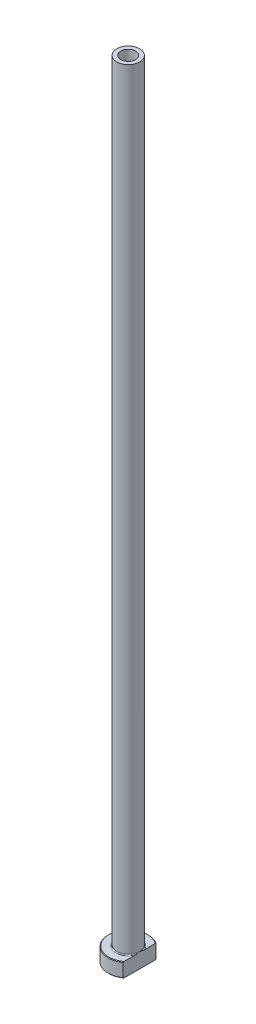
ISO-10303-21;
HEADER;
FILE_DESCRIPTION(('STEP AP214'),'2;1');
FILE_NAME('part.step','',(''),(''),'','','');
FILE_SCHEMA(('AUTOMOTIVE_DESIGN { 1 0 10303 214 1 1 1 1 }'));
ENDSEC;
DATA;
#1=APPLICATION_CONTEXT('core data for automotive mechanical design processes');
#2=APPLICATION_PROTOCOL_DEFINITION('international standard','automotive_design',2000,#1);
#3=PRODUCT_CONTEXT('',#1,'mechanical');
#4=PRODUCT('Part','Part','',(#3));
#5=PRODUCT_RELATED_PRODUCT_CATEGORY('part','',(#4));
#6=PRODUCT_DEFINITION_FORMATION('','',#4);
#7=PRODUCT_DEFINITION_CONTEXT('part definition',#1,'design');
#8=PRODUCT_DEFINITION('design','',#6,#7);
#9=PRODUCT_DEFINITION_SHAPE('','',#8);
#10=(LENGTH_UNIT() NAMED_UNIT(*) SI_UNIT(.MILLI.,.METRE.));
#11=(NAMED_UNIT(*) PLANE_ANGLE_UNIT() SI_UNIT($,.RADIAN.));
#12=(NAMED_UNIT(*) SI_UNIT($,.STERADIAN.) SOLID_ANGLE_UNIT());
#13=UNCERTAINTY_MEASURE_WITH_UNIT(LENGTH_MEASURE(1.E-05),#10,'distance_accuracy_value','');
#14=(GEOMETRIC_REPRESENTATION_CONTEXT(3) GLOBAL_UNCERTAINTY_ASSIGNED_CONTEXT((#13)) GLOBAL_UNIT_ASSIGNED_CONTEXT((#10,
#11,#12)) REPRESENTATION_CONTEXT('',''));
#15=CARTESIAN_POINT('',(0.,0.,0.));
#16=DIRECTION('',(0.,0.,1.));
#17=DIRECTION('',(1.,0.,0.));
#18=AXIS2_PLACEMENT_3D('',#15,#16,#17);
#19=CARTESIAN_POINT('',(0.,92.1876809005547,0.));
#20=DIRECTION('',(0.,1.,0.));
#21=DIRECTION('',(0.,0.,1.));
#22=AXIS2_PLACEMENT_3D('',#19,#20,#21);
#23=CYLINDRICAL_SURFACE('',#22,2.60000000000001);
#24=CARTESIAN_POINT('',(0.,275.,0.));
#25=DIRECTION('',(0.,1.,0.));
#26=DIRECTION('',(0.,0.,1.));
#27=AXIS2_PLACEMENT_3D('',#24,#25,#26);
#28=CIRCLE('',#27,2.60000000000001);
#29=CARTESIAN_POINT('',(0.,275.,2.60000000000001));
#30=VERTEX_POINT('',#29);
#31=EDGE_CURVE('E167',#30,#30,#28,.T.);
#32=ORIENTED_EDGE('',*,*,#31,.T.);
#33=EDGE_LOOP('',(#32));
#34=FACE_BOUND('',#33,.T.);
#35=CARTESIAN_POINT('',(0.,230.,0.));
#36=DIRECTION('',(0.,1.,0.));
#37=DIRECTION('',(0.,0.,1.));
#38=AXIS2_PLACEMENT_3D('',#35,#36,#37);
#39=CIRCLE('',#38,2.60000000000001);
#40=CARTESIAN_POINT('',(0.,230.,2.60000000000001));
#41=VERTEX_POINT('',#40);
#42=EDGE_CURVE('E170',#41,#41,#39,.T.);
#43=ORIENTED_EDGE('',*,*,#42,.F.);
#44=EDGE_LOOP('',(#43));
#45=FACE_BOUND('',#44,.T.);
#46=ADVANCED_FACE('F32',(#34,#45),#23,.F.);
#47=CARTESIAN_POINT('',(-2.60000000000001,275.,0.));
#48=DIRECTION('',(0.,1.,0.));
#49=DIRECTION('',(0.,0.,1.));
#50=AXIS2_PLACEMENT_3D('',#47,#48,#49);
#51=PLANE('',#50);
#52=CARTESIAN_POINT('',(0.,275.,0.));
#53=DIRECTION('',(0.,1.,0.));
#54=DIRECTION('',(0.,0.,1.));
#55=AXIS2_PLACEMENT_3D('',#52,#53,#54);
#56=CIRCLE('',#55,4.00000000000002);
#57=CARTESIAN_POINT('',(0.,275.,4.00000000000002));
#58=VERTEX_POINT('',#57);
#59=EDGE_CURVE('E174',#58,#58,#56,.T.);
#60=ORIENTED_EDGE('',*,*,#59,.T.);
#61=EDGE_LOOP('',(#60));
#62=FACE_BOUND('',#61,.T.);
#63=ORIENTED_EDGE('',*,*,#31,.F.);
#64=EDGE_LOOP('',(#63));
#65=FACE_BOUND('',#64,.T.);
#66=ADVANCED_FACE('F157',(#62,#65),#51,.T.);
#67=CARTESIAN_POINT('',(0.,92.1876809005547,0.));
#68=DIRECTION('',(0.,1.,0.));
#69=DIRECTION('',(0.,0.,1.));
#70=AXIS2_PLACEMENT_3D('',#67,#68,#69);
#71=CYLINDRICAL_SURFACE('',#70,4.00000000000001);
#72=CARTESIAN_POINT('',(0.,5.3,0.));
#73=DIRECTION('',(0.,1.,0.));
#74=DIRECTION('',(0.,0.,1.));
#75=AXIS2_PLACEMENT_3D('',#72,#73,#74);
#76=CIRCLE('',#75,4.00000000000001);
#77=CARTESIAN_POINT('',(4.,5.3,0.));
#78=VERTEX_POINT('',#77);
#79=EDGE_CURVE('E180',#78,#78,#76,.T.);
#80=ORIENTED_EDGE('',*,*,#79,.T.);
#81=EDGE_LOOP('',(#80));
#82=FACE_BOUND('',#81,.T.);
#83=ORIENTED_EDGE('',*,*,#59,.F.);
#84=EDGE_LOOP('',(#83));
#85=FACE_BOUND('',#84,.T.);
#86=ADVANCED_FACE('F162',(#82,#85),#71,.T.);
#87=CARTESIAN_POINT('',(-3.99999999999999,5.,0.));
#88=DIRECTION('',(0.,1.,0.));
#89=DIRECTION('',(0.,0.,1.));
#90=AXIS2_PLACEMENT_3D('',#87,#88,#89);
#91=PLANE('',#90);
#92=DIRECTION('',(0.,0.,1.));
#93=VECTOR('',#92,1.);
#94=CARTESIAN_POINT('',(4.,5.,0.));
#95=LINE('',#94,#93);
#96=CARTESIAN_POINT('',(4.,5.,-5.49909083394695));
#97=VERTEX_POINT('',#96);
#98=CARTESIAN_POINT('',(4.,5.,-1.57797338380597));
#99=VERTEX_POINT('',#98);
#100=EDGE_CURVE('E54',#97,#99,#95,.T.);
#101=ORIENTED_EDGE('',*,*,#100,.F.);
#102=CARTESIAN_POINT('',(0.,5.,0.));
#103=DIRECTION('',(0.,1.,0.));
#104=DIRECTION('',(0.,0.,1.));
#105=AXIS2_PLACEMENT_3D('',#102,#103,#104);
#106=CIRCLE('',#105,6.79999999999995);
#107=CARTESIAN_POINT('',(3.99999999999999,5.,5.49909083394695));
#108=VERTEX_POINT('',#107);
#109=EDGE_CURVE('E186',#97,#108,#106,.T.);
#110=ORIENTED_EDGE('',*,*,#109,.T.);
#111=CARTESIAN_POINT('',(4.,5.,1.57797338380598));
#112=VERTEX_POINT('',#111);
#113=EDGE_CURVE('E134',#112,#108,#95,.T.);
#114=ORIENTED_EDGE('',*,*,#113,.F.);
#115=CARTESIAN_POINT('',(0.,5.,0.));
#116=DIRECTION('',(0.,1.,0.));
#117=DIRECTION('',(0.,0.,1.));
#118=AXIS2_PLACEMENT_3D('',#115,#116,#117);
#119=CIRCLE('',#118,4.30000000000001);
#120=EDGE_CURVE('E183',#112,#99,#119,.F.);
#121=ORIENTED_EDGE('',*,*,#120,.T.);
#122=EDGE_LOOP('',(#101,#110,#114,#121));
#123=FACE_BOUND('',#122,.T.);
#124=ADVANCED_FACE('F197',(#123),#91,.T.);
#125=CARTESIAN_POINT('',(0.,92.1876809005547,0.));
#126=DIRECTION('',(0.,1.,0.));
#127=DIRECTION('',(0.,0.,1.));
#128=AXIS2_PLACEMENT_3D('',#125,#126,#127);
#129=CYLINDRICAL_SURFACE('',#128,6.99999999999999);
#130=DIRECTION('',(0.,-1.,0.));
#131=VECTOR('',#130,1.);
#132=CARTESIAN_POINT('',(3.99999999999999,275.,5.74456264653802));
#133=LINE('',#132,#131);
#134=CARTESIAN_POINT('',(3.99999999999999,4.79999999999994,5.74456264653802));
#135=VERTEX_POINT('',#134);
#136=CARTESIAN_POINT('',(3.99999999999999,0.20000000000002,5.74456264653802));
#137=VERTEX_POINT('',#136);
#138=EDGE_CURVE('E82',#135,#137,#133,.T.);
#139=ORIENTED_EDGE('',*,*,#138,.F.);
#140=CARTESIAN_POINT('',(0.,4.79999999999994,0.));
#141=DIRECTION('',(0.,1.,0.));
#142=DIRECTION('',(0.,0.,1.));
#143=AXIS2_PLACEMENT_3D('',#140,#141,#142);
#144=CIRCLE('',#143,6.99999999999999);
#145=CARTESIAN_POINT('',(4.,4.79999999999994,-5.74456264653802));
#146=VERTEX_POINT('',#145);
#147=EDGE_CURVE('E95',#135,#146,#144,.F.);
#148=ORIENTED_EDGE('',*,*,#147,.T.);
#149=DIRECTION('',(0.,-1.,0.));
#150=VECTOR('',#149,1.);
#151=CARTESIAN_POINT('',(4.,275.,-5.74456264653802));
#152=LINE('',#151,#150);
#153=CARTESIAN_POINT('',(4.,0.20000000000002,-5.74456264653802));
#154=VERTEX_POINT('',#153);
#155=EDGE_CURVE('E192',#146,#154,#152,.T.);
#156=ORIENTED_EDGE('',*,*,#155,.T.);
#157=CARTESIAN_POINT('',(0.,0.20000000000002,0.));
#158=DIRECTION('',(0.,-1.,0.));
#159=DIRECTION('',(0.,0.,-1.));
#160=AXIS2_PLACEMENT_3D('',#157,#158,#159);
#161=CIRCLE('',#160,6.99999999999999);
#162=EDGE_CURVE('E98',#154,#137,#161,.F.);
#163=ORIENTED_EDGE('',*,*,#162,.T.);
#164=EDGE_LOOP('',(#139,#148,#156,#163));
#165=FACE_BOUND('',#164,.T.);
#166=ADVANCED_FACE('F190',(#165),#129,.T.);
#167=CARTESIAN_POINT('',(-6.99999999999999,0.,0.));
#168=DIRECTION('',(0.,-1.,0.));
#169=DIRECTION('',(0.,0.,-1.));
#170=AXIS2_PLACEMENT_3D('',#167,#168,#169);
#171=PLANE('',#170);
#172=CARTESIAN_POINT('',(0.,0.,0.));
#173=DIRECTION('',(0.,-1.,0.));
#174=DIRECTION('',(0.,0.,-1.));
#175=AXIS2_PLACEMENT_3D('',#172,#173,#174);
#176=CIRCLE('',#175,3.34999999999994);
#177=CARTESIAN_POINT('',(0.,0.,-3.34999999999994));
#178=VERTEX_POINT('',#177);
#179=EDGE_CURVE('E40',#178,#178,#176,.F.);
#180=ORIENTED_EDGE('',*,*,#179,.T.);
#181=EDGE_LOOP('',(#180));
#182=FACE_BOUND('',#181,.T.);
#183=DIRECTION('',(0.,0.,-1.));
#184=VECTOR('',#183,1.);
#185=CARTESIAN_POINT('',(3.99999999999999,0.,5.74456264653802));
#186=LINE('',#185,#184);
#187=CARTESIAN_POINT('',(3.99999999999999,0.,5.49909083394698));
#188=VERTEX_POINT('',#187);
#189=CARTESIAN_POINT('',(4.,0.,-5.49909083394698));
#190=VERTEX_POINT('',#189);
#191=EDGE_CURVE('E47',#188,#190,#186,.T.);
#192=ORIENTED_EDGE('',*,*,#191,.F.);
#193=CARTESIAN_POINT('',(0.,0.,0.));
#194=DIRECTION('',(0.,-1.,0.));
#195=DIRECTION('',(0.,0.,-1.));
#196=AXIS2_PLACEMENT_3D('',#193,#194,#195);
#197=CIRCLE('',#196,6.79999999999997);
#198=EDGE_CURVE('E92',#188,#190,#197,.T.);
#199=ORIENTED_EDGE('',*,*,#198,.T.);
#200=EDGE_LOOP('',(#192,#199));
#201=FACE_BOUND('',#200,.T.);
#202=ADVANCED_FACE('F91',(#182,#201),#171,.T.);
#203=CARTESIAN_POINT('',(0.,92.1876809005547,0.));
#204=DIRECTION('',(0.,1.,0.));
#205=DIRECTION('',(0.,0.,1.));
#206=AXIS2_PLACEMENT_3D('',#203,#204,#205);
#207=CYLINDRICAL_SURFACE('',#206,2.85);
#208=CARTESIAN_POINT('',(0.,0.499999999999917,0.));
#209=DIRECTION('',(0.,-1.,0.));
#210=DIRECTION('',(0.,0.,-1.));
#211=AXIS2_PLACEMENT_3D('',#208,#209,#210);
#212=CIRCLE('',#211,2.85);
#213=CARTESIAN_POINT('',(0.,0.499999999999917,-2.85));
#214=VERTEX_POINT('',#213);
#215=EDGE_CURVE('E11',#214,#214,#212,.T.);
#216=ORIENTED_EDGE('',*,*,#215,.T.);
#217=EDGE_LOOP('',(#216));
#218=FACE_BOUND('',#217,.T.);
#219=CARTESIAN_POINT('',(0.,218.,0.));
#220=DIRECTION('',(0.,1.,0.));
#221=DIRECTION('',(0.,0.,1.));
#222=AXIS2_PLACEMENT_3D('',#219,#220,#221);
#223=CIRCLE('',#222,2.85000000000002);
#224=CARTESIAN_POINT('',(0.,218.,2.85000000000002));
#225=VERTEX_POINT('',#224);
#226=EDGE_CURVE('E172',#225,#225,#223,.T.);
#227=ORIENTED_EDGE('',*,*,#226,.T.);
#228=EDGE_LOOP('',(#227));
#229=FACE_BOUND('',#228,.T.);
#230=ADVANCED_FACE('F215',(#218,#229),#207,.F.);
#231=CARTESIAN_POINT('',(0.,218.,0.));
#232=DIRECTION('',(0.,-1.,0.));
#233=DIRECTION('',(0.,0.,-1.));
#234=AXIS2_PLACEMENT_3D('',#231,#232,#233);
#235=CONICAL_SURFACE('',#234,2.85000000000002,0.0208303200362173);
#236=ORIENTED_EDGE('',*,*,#42,.T.);
#237=EDGE_LOOP('',(#236));
#238=FACE_BOUND('',#237,.T.);
#239=ORIENTED_EDGE('',*,*,#226,.F.);
#240=EDGE_LOOP('',(#239));
#241=FACE_BOUND('',#240,.T.);
#242=ADVANCED_FACE('F111',(#238,#241),#235,.F.);
#243=CARTESIAN_POINT('',(0.,5.3,0.));
#244=DIRECTION('',(0.,1.,0.));
#245=DIRECTION('',(0.,0.,1.));
#246=AXIS2_PLACEMENT_3D('',#243,#244,#245);
#247=TOROIDAL_SURFACE('',#246,4.30000000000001,0.3);
#248=ORIENTED_EDGE('',*,*,#120,.F.);
#249=CARTESIAN_POINT('',(4.,5.3,0.));
#250=CARTESIAN_POINT('',(4.,5.30000062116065,-1.06261202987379E-10));
#251=CARTESIAN_POINT('',(4.,5.30000124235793,2.17726170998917E-07));
#252=CARTESIAN_POINT('',(4.,5.30000240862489,8.36141231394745E-07));
#253=CARTESIAN_POINT('',(4.,5.300002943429,1.25011707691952E-06));
#254=CARTESIAN_POINT('',(4.,5.3000040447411,2.2395937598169E-06));
#255=CARTESIAN_POINT('',(4.,5.30000459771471,2.83084509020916E-06));
#256=CARTESIAN_POINT('',(4.,5.30000559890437,4.06516656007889E-06));
#257=CARTESIAN_POINT('',(4.,5.30000604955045,4.70640133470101E-06));
#258=CARTESIAN_POINT('',(4.,5.30000769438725,7.1567729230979E-06));
#259=CARTESIAN_POINT('',(4.,5.30000879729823,9.02996083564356E-06));
#260=CARTESIAN_POINT('',(4.,5.30001063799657,1.27664899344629E-05));
#261=CARTESIAN_POINT('',(4.,5.30001139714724,1.46197817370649E-05));
#262=CARTESIAN_POINT('',(4.,5.30001453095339,2.23679241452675E-05));
#263=CARTESIAN_POINT('',(4.,5.30001683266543,2.82968776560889E-05));
#264=CARTESIAN_POINT('',(4.,5.30002027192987,3.95668761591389E-05));
#265=CARTESIAN_POINT('',(4.,5.30002152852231,4.48715490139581E-05));
#266=CARTESIAN_POINT('',(4.,5.30003060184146,8.40118246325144E-05));
#267=CARTESIAN_POINT('',(4.,5.30003739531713,0.000118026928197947));
#268=CARTESIAN_POINT('',(3.99999999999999,5.30006713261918,0.000252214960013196));
#269=CARTESIAN_POINT('',(3.99999999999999,5.30009559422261,0.000351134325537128));
#270=CARTESIAN_POINT('',(4.,5.3002062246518,0.000742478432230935));
#271=CARTESIAN_POINT('',(4.,5.30028475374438,0.00103561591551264));
#272=CARTESIAN_POINT('',(3.99999999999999,5.30059889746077,0.00219920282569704));
#273=CARTESIAN_POINT('',(3.99999999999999,5.30083905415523,0.00306873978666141));
#274=CARTESIAN_POINT('',(4.,5.30183682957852,0.00669141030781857));
#275=CARTESIAN_POINT('',(4.,5.30258877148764,0.00944568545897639));
#276=CARTESIAN_POINT('',(3.99999999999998,5.31066890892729,0.0390293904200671));
#277=CARTESIAN_POINT('',(3.99999999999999,5.31802631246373,0.0658531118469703));
#278=CARTESIAN_POINT('',(4.,5.33239676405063,0.118441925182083));
#279=CARTESIAN_POINT('',(4.,5.33941183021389,0.144206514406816));
#280=CARTESIAN_POINT('',(3.99999999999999,5.35427366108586,0.199017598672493));
#281=CARTESIAN_POINT('',(4.,5.36211313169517,0.228066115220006));
#282=CARTESIAN_POINT('',(4.,5.37776349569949,0.286511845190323));
#283=CARTESIAN_POINT('',(4.,5.38557313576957,0.315909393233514));
#284=CARTESIAN_POINT('',(4.,5.40425662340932,0.386994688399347));
#285=CARTESIAN_POINT('',(4.,5.41505237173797,0.428703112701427));
#286=CARTESIAN_POINT('',(4.,5.43592310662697,0.511098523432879));
#287=CARTESIAN_POINT('',(4.,5.44600969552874,0.551782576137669));
#288=CARTESIAN_POINT('',(4.,5.47850986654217,0.686599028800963));
#289=CARTESIAN_POINT('',(4.,5.49978370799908,0.781011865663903));
#290=CARTESIAN_POINT('',(4.,5.53807543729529,0.97184761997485));
#291=CARTESIAN_POINT('',(4.,5.55504273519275,1.06828120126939));
#292=CARTESIAN_POINT('',(4.,5.57582405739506,1.21752725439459));
#293=CARTESIAN_POINT('',(4.,5.58209796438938,1.26999379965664));
#294=CARTESIAN_POINT('',(4.,5.59210686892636,1.37516324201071));
#295=CARTESIAN_POINT('',(4.,5.59584265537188,1.42786606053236));
#296=CARTESIAN_POINT('',(4.,5.60010438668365,1.53310673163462));
#297=CARTESIAN_POINT('',(4.,5.6006487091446,1.58564378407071));
#298=CARTESIAN_POINT('',(4.,5.59767158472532,1.69058605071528));
#299=CARTESIAN_POINT('',(4.,5.59415502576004,1.74299134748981));
#300=CARTESIAN_POINT('',(4.,5.58503062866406,1.81903290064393));
#301=CARTESIAN_POINT('',(4.,5.58157617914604,1.8429293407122));
#302=CARTESIAN_POINT('',(4.,5.57329952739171,1.89051061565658));
#303=CARTESIAN_POINT('',(4.,5.56847619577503,1.91419525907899));
#304=CARTESIAN_POINT('',(4.,5.55726644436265,1.96092888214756));
#305=CARTESIAN_POINT('',(4.,5.55089740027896,1.98398195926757));
#306=CARTESIAN_POINT('',(4.,5.5362343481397,2.02945550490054));
#307=CARTESIAN_POINT('',(4.,5.52794253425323,2.05187666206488));
#308=CARTESIAN_POINT('',(4.,5.50887098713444,2.09590631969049));
#309=CARTESIAN_POINT('',(4.,5.49806837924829,2.11750508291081));
#310=CARTESIAN_POINT('',(4.,5.47333401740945,2.1588558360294));
#311=CARTESIAN_POINT('',(4.,5.45941272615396,2.17861369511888));
#312=CARTESIAN_POINT('',(4.,5.43588221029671,2.20522942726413));
#313=CARTESIAN_POINT('',(4.,5.42781139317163,2.2134404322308));
#314=CARTESIAN_POINT('',(4.,5.41065114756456,2.22875149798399));
#315=CARTESIAN_POINT('',(4.,5.40156129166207,2.23585108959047));
#316=CARTESIAN_POINT('',(4.,5.38220524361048,2.24859694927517));
#317=CARTESIAN_POINT('',(4.,5.37192420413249,2.25422119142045));
#318=CARTESIAN_POINT('',(4.,5.35045072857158,2.26331064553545));
#319=CARTESIAN_POINT('',(4.,5.33926122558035,2.26678251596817));
#320=CARTESIAN_POINT('',(4.,5.31952044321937,2.27051268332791));
#321=CARTESIAN_POINT('',(4.,5.31108453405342,2.27139016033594));
#322=CARTESIAN_POINT('',(4.,5.2941862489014,2.27168963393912));
#323=CARTESIAN_POINT('',(4.,5.28572387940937,2.27111196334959));
#324=CARTESIAN_POINT('',(4.,5.26904138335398,2.26855580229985));
#325=CARTESIAN_POINT('',(4.,5.26082066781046,2.26658107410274));
#326=CARTESIAN_POINT('',(4.,5.24478214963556,2.26139496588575));
#327=CARTESIAN_POINT('',(4.,5.23696461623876,2.25818277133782));
#328=CARTESIAN_POINT('',(4.,5.21851235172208,2.24908332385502));
#329=CARTESIAN_POINT('',(4.,5.20815219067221,2.24264095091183));
#330=CARTESIAN_POINT('',(4.,5.18857975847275,2.22819957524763));
#331=CARTESIAN_POINT('',(4.,5.1793706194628,2.22019647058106));
#332=CARTESIAN_POINT('',(4.,5.15665383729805,2.1977775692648));
#333=CARTESIAN_POINT('',(4.,5.14403484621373,2.1824690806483));
#334=CARTESIAN_POINT('',(4.,5.12118369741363,2.15020843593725));
#335=CARTESIAN_POINT('',(4.,5.11095480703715,2.13325407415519));
#336=CARTESIAN_POINT('',(4.,5.0927357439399,2.09892324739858));
#337=CARTESIAN_POINT('',(4.,5.08468212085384,2.08157988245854));
#338=CARTESIAN_POINT('',(4.,5.07005901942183,2.04627072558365));
#339=CARTESIAN_POINT('',(4.,5.06349101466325,2.0283043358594));
#340=CARTESIAN_POINT('',(4.,5.04555485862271,1.97350761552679));
#341=CARTESIAN_POINT('',(4.,5.03608974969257,1.93605770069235));
#342=CARTESIAN_POINT('',(4.,5.0178056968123,1.84529235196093));
#343=CARTESIAN_POINT('',(4.,5.01077018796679,1.79164082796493));
#344=CARTESIAN_POINT('',(4.,5.00182846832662,1.68379947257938));
#345=CARTESIAN_POINT('',(4.,4.99993887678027,1.629608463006));
#346=CARTESIAN_POINT('',(4.,5.00006129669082,1.52361204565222));
#347=CARTESIAN_POINT('',(4.,5.00190698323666,1.47180551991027));
#348=CARTESIAN_POINT('',(4.,5.00841243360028,1.36835357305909));
#349=CARTESIAN_POINT('',(4.,5.01307376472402,1.3167082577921));
#350=CARTESIAN_POINT('',(4.,5.02905484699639,1.17431887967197));
#351=CARTESIAN_POINT('',(4.,5.04274090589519,1.0838420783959));
#352=CARTESIAN_POINT('',(4.,5.06701714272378,0.947757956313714));
#353=CARTESIAN_POINT('',(4.,5.07585573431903,0.90181406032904));
#354=CARTESIAN_POINT('',(4.,5.09458665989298,0.810008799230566));
#355=CARTESIAN_POINT('',(4.,5.10448180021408,0.764148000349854));
#356=CARTESIAN_POINT('',(4.,5.12892434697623,0.65563156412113));
#357=CARTESIAN_POINT('',(3.99999999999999,5.1438355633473,0.593058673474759));
#358=CARTESIAN_POINT('',(4.,5.17458762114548,0.46888522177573));
#359=CARTESIAN_POINT('',(4.,5.1904162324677,0.407281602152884));
#360=CARTESIAN_POINT('',(3.99999999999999,5.22090834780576,0.29123270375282));
#361=CARTESIAN_POINT('',(3.99999999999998,5.23550024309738,0.236768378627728));
#362=CARTESIAN_POINT('',(4.00000000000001,5.26562550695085,0.125604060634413));
#363=CARTESIAN_POINT('',(4.00000000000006,5.28117250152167,0.0689076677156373));
#364=CARTESIAN_POINT('',(3.99999999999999,5.29741226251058,0.00944154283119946));
#365=CARTESIAN_POINT('',(3.99999999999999,5.29816540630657,0.00668315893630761));
#366=CARTESIAN_POINT('',(4.,5.29916346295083,0.0030595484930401));
#367=CARTESIAN_POINT('',(4.,5.29940273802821,0.00219318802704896));
#368=CARTESIAN_POINT('',(3.99999999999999,5.29971580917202,0.00103357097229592));
#369=CARTESIAN_POINT('',(3.99999999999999,5.29979412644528,0.000741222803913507));
#370=CARTESIAN_POINT('',(4.,5.29990450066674,0.000350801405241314));
#371=CARTESIAN_POINT('',(4.,5.29993292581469,0.000252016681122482));
#372=CARTESIAN_POINT('',(3.99999999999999,5.29996263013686,0.000117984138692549));
#373=CARTESIAN_POINT('',(3.99999999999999,5.29996941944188,8.39881937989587E-05));
#374=CARTESIAN_POINT('',(4.,5.29997848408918,4.48674039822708E-05));
#375=CARTESIAN_POINT('',(4.,5.29997973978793,3.95638216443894E-05));
#376=CARTESIAN_POINT('',(4.,5.29998317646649,2.8296036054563E-05));
#377=CARTESIAN_POINT('',(4.,5.29998547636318,2.23681472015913E-05));
#378=CARTESIAN_POINT('',(4.,5.29998860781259,1.46211010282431E-05));
#379=CARTESIAN_POINT('',(4.,5.29998936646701,1.2767890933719E-05));
#380=CARTESIAN_POINT('',(4.,5.29999120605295,9.03144135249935E-06));
#381=CARTESIAN_POINT('',(4.,5.29999230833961,7.15824151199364E-06));
#382=CARTESIAN_POINT('',(4.,5.29999395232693,4.70775561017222E-06));
#383=CARTESIAN_POINT('',(4.,5.29999440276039,4.06646426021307E-06));
#384=CARTESIAN_POINT('',(4.,5.2999954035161,2.83199126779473E-06));
#385=CARTESIAN_POINT('',(4.,5.29999595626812,2.24064376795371E-06));
#386=CARTESIAN_POINT('',(4.,5.2999970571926,1.25093996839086E-06));
#387=CARTESIAN_POINT('',(4.,5.29999759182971,8.36841285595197E-07));
#388=CARTESIAN_POINT('',(4.,5.29999875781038,2.18117851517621E-07));
#389=CARTESIAN_POINT('',(4.,5.29999937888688,1.06254280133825E-10));
#390=CARTESIAN_POINT('',(4.,5.3,0.));
#391=B_SPLINE_CURVE_WITH_KNOTS('',3,(#249,#250,#251,#252,#253,#254,#255,#256,#257,#258,#259,
#260,#261,#262,#263,#264,#265,#266,#267,#268,#269,#270,#271,#272,#273,#274,#275,#276,#277,#278,
#279,#280,#281,#282,#283,#284,#285,#286,#287,#288,#289,#290,#291,#292,#293,#294,#295,#296,#297,
#298,#299,#300,#301,#302,#303,#304,#305,#306,#307,#308,#309,#310,#311,#312,#313,#314,#315,#316,
#317,#318,#319,#320,#321,#322,#323,#324,#325,#326,#327,#328,#329,#330,#331,#332,#333,#334,#335,
#336,#337,#338,#339,#340,#341,#342,#343,#344,#345,#346,#347,#348,#349,#350,#351,#352,#353,#354,
#355,#356,#357,#358,#359,#360,#361,#362,#363,#364,#365,#366,#367,#368,#369,#370,#371,#372,#373,
#374,#375,#376,#377,#378,#379,#380,#381,#382,#383,#384,#385,#386,#387,#388,#389,#390),
.UNSPECIFIED.,.T.,.F.,(4,2,2,2,2,2,2,2,2,2,2,2,2,2,2,2,2,2,2,2,2,2,2,2,2,2,2,2,2,2,2,2,2,2,2,2,
2,2,2,2,2,2,2,2,2,2,2,2,2,2,2,2,2,2,2,2,2,2,2,2,2,2,2,2,2,2,2,2,2,2,4),(0.,1.87484306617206E-06,
3.90179830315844E-06,6.31683596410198E-06,8.66651671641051E-06,1.51627521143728E-05,
2.1165789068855E-05,4.02090737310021E-05,5.65429420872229E-05,0.000160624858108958,
0.000469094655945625,0.00137985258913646,0.0040857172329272,0.0126514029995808,
0.0960918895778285,0.176200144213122,0.266463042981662,0.357714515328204,0.486961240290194,
0.612707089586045,0.902988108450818,1.19653589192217,1.35501075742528,1.51343634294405,
1.67094875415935,1.82827177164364,1.90067591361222,1.97313996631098,2.04482437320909,
2.11642737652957,2.18871023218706,2.2607541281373,2.29521947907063,2.32969934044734,
2.36466792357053,2.39952778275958,2.42485422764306,2.45017488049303,2.47542760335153,
2.50069697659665,2.53708899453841,2.57357798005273,2.63276032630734,2.69202310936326,
2.7493031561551,2.80663977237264,2.92223125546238,3.08420752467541,3.24670629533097,
3.40212850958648,3.55763731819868,3.83192962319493,3.97228382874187,4.11302057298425,
4.30598130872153,4.49678885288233,4.66594443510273,4.84230602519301,4.85088453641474,
4.85358051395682,4.85448881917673,4.85479687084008,4.85490089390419,4.85491722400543,
4.85493626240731,4.8549422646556,4.85494875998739,4.85495110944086,4.85495352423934,
4.85495555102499,4.8549574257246),.UNSPECIFIED.);
#392=EDGE_CURVE('E126',#112,#78,#391,.T.);
#393=ORIENTED_EDGE('',*,*,#392,.T.);
#394=ORIENTED_EDGE('',*,*,#79,.F.);
#395=CARTESIAN_POINT('',(4.,5.3,0.));
#396=CARTESIAN_POINT('',(4.,5.29999937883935,1.06262596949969E-10));
#397=CARTESIAN_POINT('',(4.,5.29999875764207,-2.17726169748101E-07));
#398=CARTESIAN_POINT('',(4.,5.2999975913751,-8.36141230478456E-07));
#399=CARTESIAN_POINT('',(4.,5.299997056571,-1.25011707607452E-06));
#400=CARTESIAN_POINT('',(4.,5.2999959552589,-2.23959375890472E-06));
#401=CARTESIAN_POINT('',(4.,5.29999540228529,-2.83084508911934E-06));
#402=CARTESIAN_POINT('',(4.,5.29999440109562,-4.06516655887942E-06));
#403=CARTESIAN_POINT('',(4.,5.29999395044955,-4.70640133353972E-06));
#404=CARTESIAN_POINT('',(4.,5.29999230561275,-7.15677292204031E-06));
#405=CARTESIAN_POINT('',(4.,5.29999120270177,-9.02996083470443E-06));
#406=CARTESIAN_POINT('',(4.,5.29998936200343,-1.27664899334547E-05));
#407=CARTESIAN_POINT('',(4.,5.29998860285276,-1.46197817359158E-05));
#408=CARTESIAN_POINT('',(4.,5.29998546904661,-2.2367924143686E-05));
#409=CARTESIAN_POINT('',(4.,5.29998316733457,-2.82968776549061E-05));
#410=CARTESIAN_POINT('',(4.,5.29997972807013,-3.95668761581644E-05));
#411=CARTESIAN_POINT('',(4.,5.29997847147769,-4.48715490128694E-05));
#412=CARTESIAN_POINT('',(4.,5.29996939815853,-8.4011824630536E-05));
#413=CARTESIAN_POINT('',(4.,5.29996260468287,-0.000118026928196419));
#414=CARTESIAN_POINT('',(3.99999999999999,5.29993286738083,-0.000252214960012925));
#415=CARTESIAN_POINT('',(3.99999999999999,5.29990440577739,-0.000351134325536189));
#416=CARTESIAN_POINT('',(4.,5.29979377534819,-0.000742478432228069));
#417=CARTESIAN_POINT('',(4.,5.29971524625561,-0.00103561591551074));
#418=CARTESIAN_POINT('',(3.99999999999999,5.29940110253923,-0.00219920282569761));
#419=CARTESIAN_POINT('',(3.99999999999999,5.29916094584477,-0.00306873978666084));
#420=CARTESIAN_POINT('',(4.,5.29816317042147,-0.0066914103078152));
#421=CARTESIAN_POINT('',(4.,5.29741122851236,-0.00944568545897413));
#422=CARTESIAN_POINT('',(3.99999999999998,5.28933109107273,-0.039029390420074));
#423=CARTESIAN_POINT('',(3.99999999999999,5.28197368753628,-0.0658531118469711));
#424=CARTESIAN_POINT('',(4.,5.26760323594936,-0.118441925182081));
#425=CARTESIAN_POINT('',(4.,5.2605881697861,-0.144206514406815));
#426=CARTESIAN_POINT('',(3.99999999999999,5.24572633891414,-0.199017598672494));
#427=CARTESIAN_POINT('',(3.99999999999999,5.23788686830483,-0.228066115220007));
#428=CARTESIAN_POINT('',(4.,5.2222365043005,-0.286511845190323));
#429=CARTESIAN_POINT('',(4.,5.21442686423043,-0.315909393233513));
#430=CARTESIAN_POINT('',(4.,5.19574337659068,-0.386994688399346));
#431=CARTESIAN_POINT('',(4.,5.18494762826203,-0.428703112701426));
#432=CARTESIAN_POINT('',(4.,5.16407689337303,-0.511098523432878));
#433=CARTESIAN_POINT('',(4.,5.15399030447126,-0.551782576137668));
#434=CARTESIAN_POINT('',(4.,5.12149013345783,-0.686599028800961));
#435=CARTESIAN_POINT('',(4.,5.10021629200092,-0.781011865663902));
#436=CARTESIAN_POINT('',(4.,5.06192456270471,-0.971847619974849));
#437=CARTESIAN_POINT('',(4.,5.04495726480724,-1.06828120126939));
#438=CARTESIAN_POINT('',(4.,5.02417594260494,-1.21752725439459));
#439=CARTESIAN_POINT('',(4.,5.01790203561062,-1.26999379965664));
#440=CARTESIAN_POINT('',(4.,5.00789313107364,-1.3751632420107));
#441=CARTESIAN_POINT('',(4.,5.00415734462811,-1.42786606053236));
#442=CARTESIAN_POINT('',(4.,4.99989561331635,-1.53310673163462));
#443=CARTESIAN_POINT('',(4.,4.9993512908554,-1.58564378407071));
#444=CARTESIAN_POINT('',(4.,5.00232841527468,-1.69058605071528));
#445=CARTESIAN_POINT('',(4.,5.00584497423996,-1.74299134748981));
#446=CARTESIAN_POINT('',(4.,5.01496937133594,-1.81903290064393));
#447=CARTESIAN_POINT('',(4.,5.01842382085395,-1.8429293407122));
#448=CARTESIAN_POINT('',(4.,5.02670047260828,-1.89051061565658));
#449=CARTESIAN_POINT('',(4.,5.03152380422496,-1.91419525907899));
#450=CARTESIAN_POINT('',(4.,5.04273355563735,-1.96092888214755));
#451=CARTESIAN_POINT('',(4.,5.04910259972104,-1.98398195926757));
#452=CARTESIAN_POINT('',(4.,5.0637656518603,-2.02945550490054));
#453=CARTESIAN_POINT('',(4.,5.07205746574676,-2.05187666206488));
#454=CARTESIAN_POINT('',(4.,5.09112901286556,-2.09590631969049));
#455=CARTESIAN_POINT('',(4.,5.1019316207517,-2.11750508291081));
#456=CARTESIAN_POINT('',(4.,5.12666598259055,-2.1588558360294));
#457=CARTESIAN_POINT('',(4.,5.14058727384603,-2.17861369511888));
#458=CARTESIAN_POINT('',(4.,5.16411778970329,-2.20522942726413));
#459=CARTESIAN_POINT('',(4.,5.17218860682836,-2.21344043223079));
#460=CARTESIAN_POINT('',(4.,5.18934885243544,-2.22875149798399));
#461=CARTESIAN_POINT('',(4.,5.19843870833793,-2.23585108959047));
#462=CARTESIAN_POINT('',(4.,5.21779475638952,-2.24859694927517));
#463=CARTESIAN_POINT('',(4.,5.22807579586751,-2.25422119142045));
#464=CARTESIAN_POINT('',(4.,5.24954927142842,-2.26331064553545));
#465=CARTESIAN_POINT('',(4.,5.26073877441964,-2.26678251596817));
#466=CARTESIAN_POINT('',(4.,5.28047955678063,-2.27051268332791));
#467=CARTESIAN_POINT('',(4.,5.28891546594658,-2.27139016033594));
#468=CARTESIAN_POINT('',(4.,5.3058137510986,-2.27168963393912));
#469=CARTESIAN_POINT('',(4.,5.31427612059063,-2.27111196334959));
#470=CARTESIAN_POINT('',(4.,5.33095861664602,-2.26855580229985));
#471=CARTESIAN_POINT('',(4.,5.33917933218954,-2.26658107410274));
#472=CARTESIAN_POINT('',(4.,5.35521785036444,-2.26139496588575));
#473=CARTESIAN_POINT('',(4.,5.36303538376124,-2.25818277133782));
#474=CARTESIAN_POINT('',(4.,5.38148764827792,-2.24908332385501));
#475=CARTESIAN_POINT('',(4.,5.39184780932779,-2.24264095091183));
#476=CARTESIAN_POINT('',(4.,5.41142024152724,-2.22819957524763));
#477=CARTESIAN_POINT('',(4.,5.4206293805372,-2.22019647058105));
#478=CARTESIAN_POINT('',(4.,5.44334616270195,-2.1977775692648));
#479=CARTESIAN_POINT('',(4.,5.45596515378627,-2.1824690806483));
#480=CARTESIAN_POINT('',(4.,5.47881630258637,-2.15020843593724));
#481=CARTESIAN_POINT('',(4.,5.48904519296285,-2.13325407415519));
#482=CARTESIAN_POINT('',(4.,5.5072642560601,-2.09892324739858));
#483=CARTESIAN_POINT('',(4.,5.51531787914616,-2.08157988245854));
#484=CARTESIAN_POINT('',(4.,5.52994098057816,-2.04627072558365));
#485=CARTESIAN_POINT('',(4.,5.53650898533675,-2.0283043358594));
#486=CARTESIAN_POINT('',(4.,5.55444514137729,-1.97350761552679));
#487=CARTESIAN_POINT('',(4.,5.56391025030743,-1.93605770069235));
#488=CARTESIAN_POINT('',(4.,5.5821943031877,-1.84529235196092));
#489=CARTESIAN_POINT('',(4.,5.5892298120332,-1.79164082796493));
#490=CARTESIAN_POINT('',(4.,5.59817153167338,-1.68379947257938));
#491=CARTESIAN_POINT('',(4.,5.60006112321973,-1.629608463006));
#492=CARTESIAN_POINT('',(4.,5.59993870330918,-1.52361204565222));
#493=CARTESIAN_POINT('',(4.,5.59809301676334,-1.47180551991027));
#494=CARTESIAN_POINT('',(4.,5.59158756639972,-1.36835357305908));
#495=CARTESIAN_POINT('',(4.,5.58692623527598,-1.3167082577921));
#496=CARTESIAN_POINT('',(4.,5.57094515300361,-1.17431887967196));
#497=CARTESIAN_POINT('',(4.,5.5572590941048,-1.08384207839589));
#498=CARTESIAN_POINT('',(4.,5.53298285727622,-0.94775795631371));
#499=CARTESIAN_POINT('',(4.,5.52414426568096,-0.901814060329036));
#500=CARTESIAN_POINT('',(4.,5.50541334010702,-0.810008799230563));
#501=CARTESIAN_POINT('',(4.,5.49551819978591,-0.764148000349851));
#502=CARTESIAN_POINT('',(4.,5.47107565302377,-0.655631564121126));
#503=CARTESIAN_POINT('',(3.99999999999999,5.4561644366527,-0.593058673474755));
#504=CARTESIAN_POINT('',(4.,5.42541237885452,-0.468885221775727));
#505=CARTESIAN_POINT('',(4.,5.40958376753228,-0.407281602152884));
#506=CARTESIAN_POINT('',(3.99999999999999,5.37909165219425,-0.291232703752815));
#507=CARTESIAN_POINT('',(3.99999999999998,5.36449975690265,-0.236768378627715));
#508=CARTESIAN_POINT('',(4.00000000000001,5.33437449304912,-0.125604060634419));
#509=CARTESIAN_POINT('',(4.00000000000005,5.31882749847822,-0.0689076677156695));
#510=CARTESIAN_POINT('',(3.99999999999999,5.30258773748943,-0.009441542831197));
#511=CARTESIAN_POINT('',(3.99999999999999,5.30183459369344,-0.00668315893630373));
#512=CARTESIAN_POINT('',(4.,5.30083653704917,-0.00305954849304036));
#513=CARTESIAN_POINT('',(4.,5.30059726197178,-0.00219318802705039));
#514=CARTESIAN_POINT('',(3.99999999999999,5.30028419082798,-0.00103357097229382));
#515=CARTESIAN_POINT('',(3.99999999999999,5.30020587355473,-0.000741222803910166));
#516=CARTESIAN_POINT('',(4.,5.30009549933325,-0.000350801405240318));
#517=CARTESIAN_POINT('',(4.,5.30006707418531,-0.000252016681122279));
#518=CARTESIAN_POINT('',(3.99999999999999,5.30003736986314,-0.000117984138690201));
#519=CARTESIAN_POINT('',(3.99999999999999,5.30003058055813,-8.39881937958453E-05));
#520=CARTESIAN_POINT('',(4.,5.30002151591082,-4.48674039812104E-05));
#521=CARTESIAN_POINT('',(4.,5.30002026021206,-3.95638216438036E-05));
#522=CARTESIAN_POINT('',(4.,5.3000168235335,-2.82960360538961E-05));
#523=CARTESIAN_POINT('',(4.,5.30001452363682,-2.23681472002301E-05));
#524=CARTESIAN_POINT('',(4.,5.30001139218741,-1.462110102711E-05));
#525=CARTESIAN_POINT('',(4.,5.30001063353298,-1.27678909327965E-05));
#526=CARTESIAN_POINT('',(4.,5.30000879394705,-9.03144135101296E-06));
#527=CARTESIAN_POINT('',(4.,5.30000769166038,-7.15824150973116E-06));
#528=CARTESIAN_POINT('',(4.,5.30000604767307,-4.70775560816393E-06));
#529=CARTESIAN_POINT('',(4.,5.30000559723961,-4.06646425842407E-06));
#530=CARTESIAN_POINT('',(4.,5.30000459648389,-2.83199126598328E-06));
#531=CARTESIAN_POINT('',(4.,5.30000404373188,-2.24064376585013E-06));
#532=CARTESIAN_POINT('',(4.,5.30000294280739,-1.25093996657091E-06));
#533=CARTESIAN_POINT('',(4.,5.30000240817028,-8.36841284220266E-07));
#534=CARTESIAN_POINT('',(4.,5.30000124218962,-2.18117850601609E-07));
#535=CARTESIAN_POINT('',(4.,5.30000062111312,-1.06253258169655E-10));
#536=CARTESIAN_POINT('',(4.,5.3,0.));
#537=B_SPLINE_CURVE_WITH_KNOTS('',3,(#395,#396,#397,#398,#399,#400,#401,#402,#403,#404,#405,
#406,#407,#408,#409,#410,#411,#412,#413,#414,#415,#416,#417,#418,#419,#420,#421,#422,#423,#424,
#425,#426,#427,#428,#429,#430,#431,#432,#433,#434,#435,#436,#437,#438,#439,#440,#441,#442,#443,
#444,#445,#446,#447,#448,#449,#450,#451,#452,#453,#454,#455,#456,#457,#458,#459,#460,#461,#462,
#463,#464,#465,#466,#467,#468,#469,#470,#471,#472,#473,#474,#475,#476,#477,#478,#479,#480,#481,
#482,#483,#484,#485,#486,#487,#488,#489,#490,#491,#492,#493,#494,#495,#496,#497,#498,#499,#500,
#501,#502,#503,#504,#505,#506,#507,#508,#509,#510,#511,#512,#513,#514,#515,#516,#517,#518,#519,
#520,#521,#522,#523,#524,#525,#526,#527,#528,#529,#530,#531,#532,#533,#534,#535,#536),
.UNSPECIFIED.,.T.,.F.,(4,2,2,2,2,2,2,2,2,2,2,2,2,2,2,2,2,2,2,2,2,2,2,2,2,2,2,2,2,2,2,2,2,2,2,2,
2,2,2,2,2,2,2,2,2,2,2,2,2,2,2,2,2,2,2,2,2,2,2,2,2,2,2,2,2,2,2,2,2,2,4),(0.,1.87484306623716E-06,
3.90179830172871E-06,6.31683596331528E-06,8.66651671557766E-06,1.51627521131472E-05,
2.11657890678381E-05,4.02090737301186E-05,5.65429420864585E-05,0.000160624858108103,
0.000469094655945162,0.00137985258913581,0.00408571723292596,0.0126514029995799,
0.0960918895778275,0.176200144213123,0.266463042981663,0.357714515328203,0.486961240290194,
0.612707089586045,0.902988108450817,1.19653589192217,1.35501075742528,1.51343634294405,
1.67094875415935,1.82827177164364,1.90067591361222,1.97313996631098,2.04482437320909,
2.11642737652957,2.18871023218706,2.2607541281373,2.29521947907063,2.32969934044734,
2.36466792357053,2.39952778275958,2.42485422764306,2.45017488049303,2.47542760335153,
2.50069697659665,2.53708899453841,2.57357798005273,2.63276032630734,2.69202310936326,
2.7493031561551,2.80663977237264,2.92223125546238,3.08420752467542,3.24670629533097,
3.40212850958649,3.55763731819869,3.83192962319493,3.97228382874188,4.11302057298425,
4.30598130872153,4.49678885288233,4.66594443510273,4.84230602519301,4.85088453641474,
4.85358051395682,4.85448881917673,4.85479687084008,4.85490089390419,4.85491722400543,
4.85493626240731,4.8549422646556,4.85494875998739,4.85495110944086,4.85495352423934,
4.85495555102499,4.8549574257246),.UNSPECIFIED.);
#538=EDGE_CURVE('E135',#78,#99,#537,.T.);
#539=ORIENTED_EDGE('',*,*,#538,.T.);
#540=EDGE_LOOP('',(#248,#393,#394,#539));
#541=FACE_BOUND('',#540,.T.);
#542=ADVANCED_FACE('F141',(#541),#247,.F.);
#543=CARTESIAN_POINT('',(0.,5.,0.));
#544=DIRECTION('',(0.,-1.,0.));
#545=DIRECTION('',(0.,0.,-1.));
#546=AXIS2_PLACEMENT_3D('',#543,#544,#545);
#547=CONICAL_SURFACE('',#546,6.79999999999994,0.785398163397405);
#548=CARTESIAN_POINT('',(4.,-1.45712845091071,-12.6392822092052));
#549=CARTESIAN_POINT('',(4.,-1.24364466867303,-12.4153556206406));
#550=CARTESIAN_POINT('',(4.,-1.0304243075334,-12.1911774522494));
#551=CARTESIAN_POINT('',(4.,-0.604617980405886,-11.7422167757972));
#552=CARTESIAN_POINT('',(4.,-0.39203201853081,-11.5174342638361));
#553=CARTESIAN_POINT('',(4.,0.0324624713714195,-11.0670952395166));
#554=CARTESIAN_POINT('',(4.,0.244370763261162,-10.8415385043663));
#555=CARTESIAN_POINT('',(4.,0.667290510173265,-10.3895875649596));
#556=CARTESIAN_POINT('',(4.,0.878301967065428,-10.1631933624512));
#557=CARTESIAN_POINT('',(4.,1.51385375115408,-9.47810122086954));
#558=CARTESIAN_POINT('',(4.,1.93676291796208,-9.01788214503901));
#559=CARTESIAN_POINT('',(4.,2.56612335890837,-8.32309905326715));
#560=CARTESIAN_POINT('',(4.,2.7750566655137,-8.09078457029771));
#561=CARTESIAN_POINT('',(4.,3.19080254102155,-7.62426940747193));
#562=CARTESIAN_POINT('',(4.,3.39761512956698,-7.39006874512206));
#563=CARTESIAN_POINT('',(4.,3.87870763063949,-6.83891844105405));
#564=CARTESIAN_POINT('',(4.,4.15190978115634,-6.52102188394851));
#565=CARTESIAN_POINT('',(4.,4.55642425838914,-6.03960901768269));
#566=CARTESIAN_POINT('',(4.,4.69041050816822,-5.87833992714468));
#567=CARTESIAN_POINT('',(4.,4.95616531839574,-5.55398469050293));
#568=CARTESIAN_POINT('',(4.,5.08793391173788,-5.39089857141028));
#569=CARTESIAN_POINT('',(4.,5.34841712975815,-5.06288801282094));
#570=CARTESIAN_POINT('',(4.,5.47713786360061,-4.89796843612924));
#571=CARTESIAN_POINT('',(4.,5.73107494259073,-4.56545535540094));
#572=CARTESIAN_POINT('',(4.,5.85629144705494,-4.39786197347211));
#573=CARTESIAN_POINT('',(4.,6.10211465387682,-4.05948444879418));
#574=CARTESIAN_POINT('',(4.,6.22272435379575,-3.88870249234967));
#575=CARTESIAN_POINT('',(4.,6.45796076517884,-3.5430831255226));
#576=CARTESIAN_POINT('',(4.,6.57258867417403,-3.3682465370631));
#577=CARTESIAN_POINT('',(4.,6.76866603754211,-3.05381396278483));
#578=CARTESIAN_POINT('',(4.,6.85173773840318,-2.9152335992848));
#579=CARTESIAN_POINT('',(4.,7.01174537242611,-2.63451965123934));
#580=CARTESIAN_POINT('',(4.,7.088680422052,-2.49238555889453));
#581=CARTESIAN_POINT('',(4.,7.23459437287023,-2.20416961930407));
#582=CARTESIAN_POINT('',(4.,7.30357836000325,-2.05809037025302));
#583=CARTESIAN_POINT('',(4.,7.43135520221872,-1.7615173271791));
#584=CARTESIAN_POINT('',(4.,7.49015114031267,-1.61102488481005));
#585=CARTESIAN_POINT('',(4.,7.58249315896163,-1.3414209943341));
#586=CARTESIAN_POINT('',(4.,7.61872660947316,-1.22323501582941));
#587=CARTESIAN_POINT('',(4.,7.68223354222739,-0.984492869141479));
#588=CARTESIAN_POINT('',(4.,7.70951040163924,-0.863937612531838));
#589=CARTESIAN_POINT('',(4.,7.7537791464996,-0.621342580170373));
#590=CARTESIAN_POINT('',(4.,7.77080509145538,-0.499309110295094));
#591=CARTESIAN_POINT('',(4.,7.79378778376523,-0.25419448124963));
#592=CARTESIAN_POINT('',(4.,7.79974523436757,-0.13111338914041));
#593=CARTESIAN_POINT('',(4.,7.80023957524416,0.115517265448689));
#594=CARTESIAN_POINT('',(4.,7.79473514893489,0.23906691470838));
#595=CARTESIAN_POINT('',(4.,7.77255119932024,0.485148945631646));
#596=CARTESIAN_POINT('',(4.,7.75587091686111,0.607681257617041));
#597=CARTESIAN_POINT('',(4.,7.71218353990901,0.851269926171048));
#598=CARTESIAN_POINT('',(4.,7.68514362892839,0.972320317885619));
#599=CARTESIAN_POINT('',(4.,7.62201202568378,1.21200276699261));
#600=CARTESIAN_POINT('',(4.,7.58591962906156,1.3306346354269));
#601=CARTESIAN_POINT('',(4.,7.4598007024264,1.70122439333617));
#602=CARTESIAN_POINT('',(4.,7.35572950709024,1.94843335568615));
#603=CARTESIAN_POINT('',(4.,7.18186715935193,2.31048534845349));
#604=CARTESIAN_POINT('',(4.,7.12087684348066,2.42983561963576));
#605=CARTESIAN_POINT('',(4.,6.99403531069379,2.66593629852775));
#606=CARTESIAN_POINT('',(3.99999999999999,6.9281846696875,2.78268701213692));
#607=CARTESIAN_POINT('',(3.99999999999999,6.79157875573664,3.01550895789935));
#608=CARTESIAN_POINT('',(3.99999999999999,6.72076681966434,3.1315466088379));
#609=CARTESIAN_POINT('',(3.99999999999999,6.57583116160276,3.36153379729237));
#610=CARTESIAN_POINT('',(3.99999999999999,6.50170736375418,3.47548328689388));
#611=CARTESIAN_POINT('',(3.99999999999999,6.35080982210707,3.70145107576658));
#612=CARTESIAN_POINT('',(3.99999999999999,6.27403866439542,3.8134711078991));
#613=CARTESIAN_POINT('',(3.99999999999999,6.11824120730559,4.03592316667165));
#614=CARTESIAN_POINT('',(3.99999999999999,6.03921496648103,4.14635523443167));
#615=CARTESIAN_POINT('',(3.99999999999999,5.81506547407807,4.45397159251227));
#616=CARTESIAN_POINT('',(3.99999999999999,5.66782256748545,4.6496112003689));
#617=CARTESIAN_POINT('',(3.99999999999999,5.36880597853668,5.03740600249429));
#618=CARTESIAN_POINT('',(3.99999999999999,5.21703183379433,5.22956083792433));
#619=CARTESIAN_POINT('',(3.99999999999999,4.90999105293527,5.61115465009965));
#620=CARTESIAN_POINT('',(3.99999999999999,4.75472331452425,5.80059273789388));
#621=CARTESIAN_POINT('',(3.99999999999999,4.44150758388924,6.17724364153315));
#622=CARTESIAN_POINT('',(3.99999999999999,4.28355951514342,6.36445639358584));
#623=CARTESIAN_POINT('',(3.99999999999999,3.96525805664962,6.73740614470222));
#624=CARTESIAN_POINT('',(3.99999999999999,3.80490084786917,6.92313987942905));
#625=CARTESIAN_POINT('',(3.99999999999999,3.48247055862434,7.29311320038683));
#626=CARTESIAN_POINT('',(3.99999999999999,3.32039746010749,7.47735277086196));
#627=CARTESIAN_POINT('',(3.99999999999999,2.83216188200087,8.02814826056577));
#628=CARTESIAN_POINT('',(3.99999999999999,2.50391696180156,8.39285790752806));
#629=CARTESIAN_POINT('',(3.99999999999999,1.87512078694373,9.08414492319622));
#630=CARTESIAN_POINT('',(3.99999999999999,1.57491666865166,9.4110392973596));
#631=CARTESIAN_POINT('',(3.99999999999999,0.972153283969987,10.0626830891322));
#632=CARTESIAN_POINT('',(3.99999999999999,0.669593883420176,10.387432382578));
#633=CARTESIAN_POINT('',(3.99999999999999,0.0637759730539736,11.0341169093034));
#634=CARTESIAN_POINT('',(3.99999999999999,-0.239476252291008,11.356058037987));
#635=CARTESIAN_POINT('',(3.99999999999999,-0.847356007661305,11.9985921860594));
#636=CARTESIAN_POINT('',(3.99999999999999,-1.15198342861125,12.3191853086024));
#637=CARTESIAN_POINT('',(3.99999999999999,-1.45712845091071,12.6392822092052));
#638=B_SPLINE_CURVE_WITH_KNOTS('',3,(#548,#549,#550,#551,#552,#553,#554,#555,#556,#557,#558,
#559,#560,#561,#562,#563,#564,#565,#566,#567,#568,#569,#570,#571,#572,#573,#574,#575,#576,#577,
#578,#579,#580,#581,#582,#583,#584,#585,#586,#587,#588,#589,#590,#591,#592,#593,#594,#595,#596,
#597,#598,#599,#600,#601,#602,#603,#604,#605,#606,#607,#608,#609,#610,#611,#612,#613,#614,#615,
#616,#617,#618,#619,#620,#621,#622,#623,#624,#625,#626,#627,#628,#629,#630,#631,#632,#633,#634,
#635,#636,#637),.UNSPECIFIED.,.F.,.F.,(4,2,2,2,2,2,2,2,2,2,2,2,2,2,2,2,2,2,2,2,2,2,2,2,2,2,2,2,
2,2,2,2,2,2,2,2,2,2,2,2,2,2,2,2,4),(0.,0.928152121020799,1.85631024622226,2.78476262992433,
3.71321307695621,5.58823033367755,6.52556078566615,7.46288254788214,8.7202857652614,
9.34927045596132,9.97824580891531,10.6058302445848,11.2333861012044,11.860526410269,
12.4875406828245,12.9721363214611,13.4568016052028,13.9411551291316,14.4253618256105,
14.7959147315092,15.1663277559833,15.5355031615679,15.9046551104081,16.2751400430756,
16.645650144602,17.0173437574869,17.3890663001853,18.1913996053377,18.5934522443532,
18.9954573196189,19.403210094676,19.8109722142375,20.2183467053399,20.625710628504,
21.3601838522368,22.0947322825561,22.8295158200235,23.5643203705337,24.3004480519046,
25.0365834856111,26.5085499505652,27.8400191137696,29.1715646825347,30.4983881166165,
31.8251080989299),.UNSPECIFIED.);
#639=EDGE_CURVE('E133',#146,#97,#638,.T.);
#640=ORIENTED_EDGE('',*,*,#639,.F.);
#641=ORIENTED_EDGE('',*,*,#147,.F.);
#642=EDGE_CURVE('E118',#108,#135,#638,.T.);
#643=ORIENTED_EDGE('',*,*,#642,.F.);
#644=ORIENTED_EDGE('',*,*,#109,.F.);
#645=EDGE_LOOP('',(#640,#641,#643,#644));
#646=FACE_BOUND('',#645,.T.);
#647=ADVANCED_FACE('F145',(#646),#547,.T.);
#648=CARTESIAN_POINT('',(0.,0.20000000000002,0.));
#649=DIRECTION('',(0.,1.,0.));
#650=DIRECTION('',(0.,0.,1.));
#651=AXIS2_PLACEMENT_3D('',#648,#649,#650);
#652=CONICAL_SURFACE('',#651,6.99999999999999,0.78539816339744);
#653=CARTESIAN_POINT('',(3.99999999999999,6.45712845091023,12.6392822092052));
#654=CARTESIAN_POINT('',(3.99999999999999,6.24364466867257,12.4153556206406));
#655=CARTESIAN_POINT('',(3.99999999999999,6.03042430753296,12.1911774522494));
#656=CARTESIAN_POINT('',(3.99999999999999,5.60461798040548,11.7422167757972));
#657=CARTESIAN_POINT('',(3.99999999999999,5.39203201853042,11.5174342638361));
#658=CARTESIAN_POINT('',(3.99999999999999,4.96753752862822,11.0670952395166));
#659=CARTESIAN_POINT('',(3.99999999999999,4.75562923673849,10.8415385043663));
#660=CARTESIAN_POINT('',(3.99999999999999,4.33270948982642,10.3895875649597));
#661=CARTESIAN_POINT('',(3.99999999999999,4.12169803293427,10.1631933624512));
#662=CARTESIAN_POINT('',(3.99999999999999,3.48614624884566,9.47810122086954));
#663=CARTESIAN_POINT('',(3.99999999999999,3.06323708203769,9.01788214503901));
#664=CARTESIAN_POINT('',(3.99999999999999,2.43387664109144,8.32309905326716));
#665=CARTESIAN_POINT('',(3.99999999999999,2.22494333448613,8.09078457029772));
#666=CARTESIAN_POINT('',(3.99999999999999,1.80919745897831,7.62426940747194));
#667=CARTESIAN_POINT('',(3.99999999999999,1.60238487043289,7.39006874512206));
#668=CARTESIAN_POINT('',(3.99999999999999,1.1212923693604,6.83891844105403));
#669=CARTESIAN_POINT('',(3.99999999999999,0.84809021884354,6.52102188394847));
#670=CARTESIAN_POINT('',(3.99999999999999,0.443575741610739,6.0396090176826));
#671=CARTESIAN_POINT('',(3.99999999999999,0.309589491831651,5.87833992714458));
#672=CARTESIAN_POINT('',(3.99999999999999,0.0438346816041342,5.55398469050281));
#673=CARTESIAN_POINT('',(3.99999999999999,-0.0879339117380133,5.39089857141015));
#674=CARTESIAN_POINT('',(3.99999999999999,-0.348417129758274,5.06288801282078));
#675=CARTESIAN_POINT('',(3.99999999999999,-0.477137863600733,4.89796843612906));
#676=CARTESIAN_POINT('',(3.99999999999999,-0.731074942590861,4.56545535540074));
#677=CARTESIAN_POINT('',(3.99999999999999,-0.856291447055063,4.39786197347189));
#678=CARTESIAN_POINT('',(3.99999999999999,-1.10211465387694,4.05948444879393));
#679=CARTESIAN_POINT('',(3.99999999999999,-1.22272435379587,3.88870249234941));
#680=CARTESIAN_POINT('',(3.99999999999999,-1.45796076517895,3.54308312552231));
#681=CARTESIAN_POINT('',(3.99999999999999,-1.57258867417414,3.3682465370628));
#682=CARTESIAN_POINT('',(3.99999999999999,-1.76866603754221,3.0538139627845));
#683=CARTESIAN_POINT('',(4.,-1.85173773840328,2.91523359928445));
#684=CARTESIAN_POINT('',(4.,-2.01174537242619,2.63451965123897));
#685=CARTESIAN_POINT('',(4.,-2.08868042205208,2.49238555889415));
#686=CARTESIAN_POINT('',(4.,-2.23459437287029,2.20416961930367));
#687=CARTESIAN_POINT('',(4.,-2.30357836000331,2.0580903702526));
#688=CARTESIAN_POINT('',(4.,-2.43135520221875,1.76151732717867));
#689=CARTESIAN_POINT('',(4.,-2.49015114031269,1.6110248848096));
#690=CARTESIAN_POINT('',(4.,-2.58249315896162,1.34142099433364));
#691=CARTESIAN_POINT('',(4.,-2.61872660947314,1.22323501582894));
#692=CARTESIAN_POINT('',(4.,-2.68223354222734,0.984492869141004));
#693=CARTESIAN_POINT('',(4.,-2.70951040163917,0.86393761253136));
#694=CARTESIAN_POINT('',(4.,-2.7537791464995,0.621342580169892));
#695=CARTESIAN_POINT('',(4.,-2.77080509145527,0.499309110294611));
#696=CARTESIAN_POINT('',(4.,-2.79378778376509,0.254194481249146));
#697=CARTESIAN_POINT('',(4.,-2.79974523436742,0.131113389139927));
#698=CARTESIAN_POINT('',(4.,-2.80023957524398,-0.115517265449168));
#699=CARTESIAN_POINT('',(4.,-2.79473514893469,-0.239066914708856));
#700=CARTESIAN_POINT('',(4.,-2.77255119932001,-0.485148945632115));
#701=CARTESIAN_POINT('',(4.,-2.75587091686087,-0.607681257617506));
#702=CARTESIAN_POINT('',(4.,-2.71218353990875,-0.851269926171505));
#703=CARTESIAN_POINT('',(4.,-2.68514362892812,-0.972320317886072));
#704=CARTESIAN_POINT('',(4.,-2.62201202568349,-1.21200276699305));
#705=CARTESIAN_POINT('',(4.,-2.58591962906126,-1.33063463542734));
#706=CARTESIAN_POINT('',(4.,-2.45980070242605,-1.7012243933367));
#707=CARTESIAN_POINT('',(4.,-2.35572950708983,-1.94843335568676));
#708=CARTESIAN_POINT('',(4.,-2.18186715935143,-2.31048534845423));
#709=CARTESIAN_POINT('',(4.,-2.12087684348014,-2.42983561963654));
#710=CARTESIAN_POINT('',(4.,-1.99403531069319,-2.66593629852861));
#711=CARTESIAN_POINT('',(4.,-1.92818466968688,-2.78268701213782));
#712=CARTESIAN_POINT('',(4.,-1.79157875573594,-3.01550895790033));
#713=CARTESIAN_POINT('',(4.,-1.72076681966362,-3.13154660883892));
#714=CARTESIAN_POINT('',(4.,-1.57583116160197,-3.36153379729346));
#715=CARTESIAN_POINT('',(4.,-1.50170736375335,-3.47548328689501));
#716=CARTESIAN_POINT('',(4.,-1.35080982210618,-3.70145107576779));
#717=CARTESIAN_POINT('',(4.,-1.27403866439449,-3.81347110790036));
#718=CARTESIAN_POINT('',(4.,-1.1182412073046,-4.03592316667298));
#719=CARTESIAN_POINT('',(4.,-1.03921496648,-4.14635523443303));
#720=CARTESIAN_POINT('',(4.,-0.81506547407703,-4.45397159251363));
#721=CARTESIAN_POINT('',(4.,-0.667822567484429,-4.64961120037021));
#722=CARTESIAN_POINT('',(4.,-0.368805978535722,-5.03740600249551));
#723=CARTESIAN_POINT('',(4.,-0.217031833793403,-5.2295608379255));
#724=CARTESIAN_POINT('',(4.,0.0900089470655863,-5.61115465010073));
#725=CARTESIAN_POINT('',(4.,0.245276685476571,-5.80059273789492));
#726=CARTESIAN_POINT('',(4.,0.558492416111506,-6.17724364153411));
#727=CARTESIAN_POINT('',(4.,0.71644048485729,-6.36445639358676));
#728=CARTESIAN_POINT('',(4.,1.03474194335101,-6.73740614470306));
#729=CARTESIAN_POINT('',(4.,1.19509915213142,-6.92313987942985));
#730=CARTESIAN_POINT('',(4.,1.51752944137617,-7.29311320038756));
#731=CARTESIAN_POINT('',(4.,1.67960253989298,-7.47735277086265));
#732=CARTESIAN_POINT('',(4.,2.16783811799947,-8.02814826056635));
#733=CARTESIAN_POINT('',(4.,2.4960830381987,-8.39285790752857));
#734=CARTESIAN_POINT('',(4.,3.12487921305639,-9.08414492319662));
#735=CARTESIAN_POINT('',(4.,3.4250833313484,-9.41103929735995));
#736=CARTESIAN_POINT('',(4.,4.02784671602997,-10.0626830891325));
#737=CARTESIAN_POINT('',(4.,4.33040611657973,-10.3874323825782));
#738=CARTESIAN_POINT('',(4.,4.93622402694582,-11.0341169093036));
#739=CARTESIAN_POINT('',(4.,5.23947625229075,-11.3560580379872));
#740=CARTESIAN_POINT('',(4.,5.84735600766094,-11.9985921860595));
#741=CARTESIAN_POINT('',(4.,6.15198342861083,-12.3191853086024));
#742=CARTESIAN_POINT('',(4.,6.45712845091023,-12.6392822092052));
#743=B_SPLINE_CURVE_WITH_KNOTS('',3,(#653,#654,#655,#656,#657,#658,#659,#660,#661,#662,#663,
#664,#665,#666,#667,#668,#669,#670,#671,#672,#673,#674,#675,#676,#677,#678,#679,#680,#681,#682,
#683,#684,#685,#686,#687,#688,#689,#690,#691,#692,#693,#694,#695,#696,#697,#698,#699,#700,#701,
#702,#703,#704,#705,#706,#707,#708,#709,#710,#711,#712,#713,#714,#715,#716,#717,#718,#719,#720,
#721,#722,#723,#724,#725,#726,#727,#728,#729,#730,#731,#732,#733,#734,#735,#736,#737,#738,#739,
#740,#741,#742),.UNSPECIFIED.,.F.,.F.,(4,2,2,2,2,2,2,2,2,2,2,2,2,2,2,2,2,2,2,2,2,2,2,2,2,2,2,2,
2,2,2,2,2,2,2,2,2,2,2,2,2,2,2,2,4),(0.,0.928152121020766,1.85631024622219,2.78476262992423,
3.71321307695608,5.58823033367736,6.52556078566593,7.46288254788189,8.72028576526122,
9.34927045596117,9.9782458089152,10.6058302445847,11.2333861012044,11.860526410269,
12.4875406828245,12.9721363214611,13.4568016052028,13.9411551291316,14.4253618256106,
14.7959147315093,15.1663277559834,15.535503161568,15.9046551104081,16.2751400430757,
16.645650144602,17.017343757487,17.3890663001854,18.1913996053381,18.5934522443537,
18.9954573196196,19.4032100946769,19.8109722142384,20.218346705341,20.6257106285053,
21.3601838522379,22.0947322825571,22.8295158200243,23.5643203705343,24.3004480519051,
25.0365834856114,26.5085499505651,27.8400191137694,29.1715646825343,30.4983881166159,
31.8251080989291),.UNSPECIFIED.);
#744=EDGE_CURVE('E79',#137,#188,#743,.T.);
#745=ORIENTED_EDGE('',*,*,#744,.F.);
#746=ORIENTED_EDGE('',*,*,#162,.F.);
#747=EDGE_CURVE('E87',#190,#154,#743,.T.);
#748=ORIENTED_EDGE('',*,*,#747,.F.);
#749=ORIENTED_EDGE('',*,*,#198,.F.);
#750=EDGE_LOOP('',(#745,#746,#748,#749));
#751=FACE_BOUND('',#750,.T.);
#752=ADVANCED_FACE('F94',(#751),#652,.T.);
#753=CARTESIAN_POINT('',(3.99999999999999,275.,5.74456264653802));
#754=DIRECTION('',(-1.,0.,0.));
#755=DIRECTION('',(0.,0.,1.));
#756=AXIS2_PLACEMENT_3D('',#753,#754,#755);
#757=PLANE('',#756);
#758=ORIENTED_EDGE('',*,*,#392,.F.);
#759=ORIENTED_EDGE('',*,*,#113,.T.);
#760=ORIENTED_EDGE('',*,*,#642,.T.);
#761=ORIENTED_EDGE('',*,*,#138,.T.);
#762=ORIENTED_EDGE('',*,*,#744,.T.);
#763=ORIENTED_EDGE('',*,*,#191,.T.);
#764=ORIENTED_EDGE('',*,*,#747,.T.);
#765=ORIENTED_EDGE('',*,*,#155,.F.);
#766=ORIENTED_EDGE('',*,*,#639,.T.);
#767=ORIENTED_EDGE('',*,*,#100,.T.);
#768=ORIENTED_EDGE('',*,*,#538,.F.);
#769=EDGE_LOOP('',(#758,#759,#760,#761,#762,#763,#764,#765,#766,#767,#768));
#770=FACE_BOUND('',#769,.T.);
#771=ADVANCED_FACE('F80',(#770),#757,.F.);
#772=CARTESIAN_POINT('',(0.,0.,0.));
#773=DIRECTION('',(0.,-1.,0.));
#774=DIRECTION('',(0.,0.,-1.));
#775=AXIS2_PLACEMENT_3D('',#772,#773,#774);
#776=CONICAL_SURFACE('',#775,3.34999999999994,0.785398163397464);
#777=ORIENTED_EDGE('',*,*,#215,.F.);
#778=EDGE_LOOP('',(#777));
#779=FACE_BOUND('',#778,.T.);
#780=ORIENTED_EDGE('',*,*,#179,.F.);
#781=EDGE_LOOP('',(#780));
#782=FACE_BOUND('',#781,.T.);
#783=ADVANCED_FACE('F34',(#779,#782),#776,.F.);
#784=CLOSED_SHELL('',(#46,#66,#86,#124,#166,#202,#230,#242,#542,#647,#752,#771,#783));
#785=MANIFOLD_SOLID_BREP('B2',#784);
#786=ADVANCED_BREP_SHAPE_REPRESENTATION('',(#18,#785),#14);
#787=SHAPE_DEFINITION_REPRESENTATION(#9,#786);
ENDSEC;
END-ISO-10303-21;
